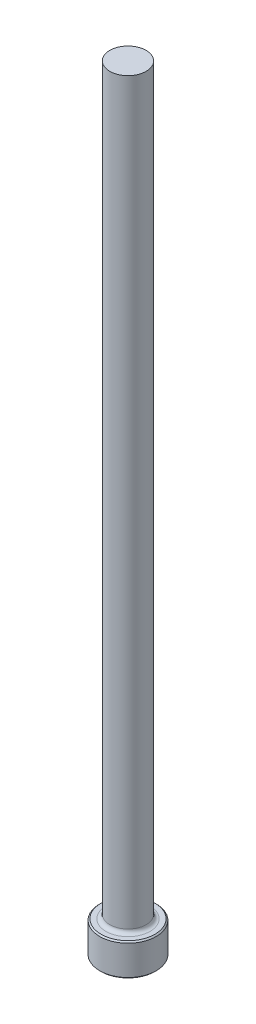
from build123d import *

# Parameters (mm, degrees)
CHAMFER1_SIZE = 0.254
FILLET1_R     = 0.762


with BuildPart() as part:
    # Sketch1 → Revolve1 (revolve)
    with BuildSketch(Plane.XY, mode=Mode.PRIVATE) as revolve1_sk:
        Polygon((0, 0), (-5.5499, 0), (-5.5499, 6.35), (-3.57124, 6.35), (-3.57124, 152.4), (0, 152.4), align=None)
    revolve(revolve1_sk.sketch.rotate(Axis((0, 259.958771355, 0), (0, -1, 0)), 270), axis=Axis((0, 259.958771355, 0), (0, -1, 0)))

    # Chamfer1
    chamfer1_edges = [part.edges().sort_by_distance(p)[0] for p in [
        (0, 6.35, -5.5499),
        (0, 0, -5.5499),
    ]]
    chamfer(chamfer1_edges, length=CHAMFER1_SIZE)

    # Fillet1
    fillet1_edges = [part.edges().sort_by_distance(p)[0] for p in [
        (0, 6.35, -3.57124),
    ]]
    fillet(fillet1_edges, radius=FILLET1_R)


solid = part.part
